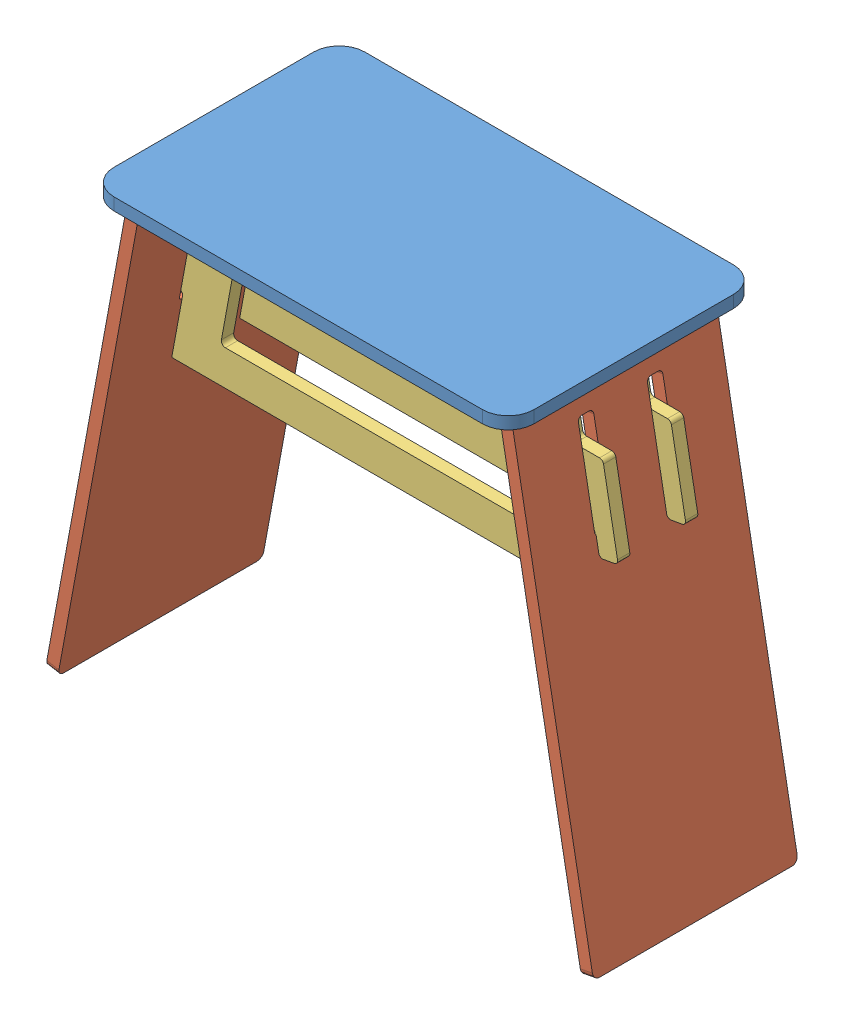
SolidWorks assembly Assem1.sldasm, configuration Default (file format 10000). Lengths in mm.
Overall size (533.01 452.79 245).
5 component instances, 3 part files, 14 mates.
Components (placement in the parent):
- base-1: base.SLDPRT [Default] at (76.5416 12 -122.5) x (0 0 -1) z (-1 0 0) size (245 12 410)
- legs-1: legs.SLDPRT [Default] at (290.2888 -218.4832 -121.7633) x (0.181175 -0.983451 0) z (0 0 1) size (452.1 12 200)
- Spine-1: Spine.SLDPRT [Default] at (-129.8084 -178.33 -94.79) x (1 0 0) z (0 -1 0) size (458.04 12 184.33)
- legs-2: legs.SLDPRT [Default] at (-149.007 -216.3091 -119.8633) x (-0.181175 -0.983451 0) z (0 0 1) size (452.1 12 200)
- Spine-2: Spine.SLDPRT [Default] at (-129.8084 -178.33 -161.12) x (1 0 0) z (0 -1 0) size (458.04 12 184.33)
Mates (geometry in assembly coordinates):
- Coincident2: coincident: plane of base-1 through (76.5416 0 -122.5) normal (0 -1 0); plane of assembly through (0 0 0) normal (0 1 0)
- Coincident3: coincident aligned: plane of base-1 through (76.5416 0 0) normal (0 0 1); plane of assembly through (0 0 0) normal (0 0 1)
- Coincident4: coincident: plane of base-1 through (76.5416 6 -122.5) normal (0 -1 0); plane of Spine-2 through (249.5416 6 -149.12) normal (0 1 0)
- Coincident5: coincident: plane of base-1 through (76.5416 6 -122.5) normal (0 -1 0); plane of Spine-1 through (249.5416 6 -82.79) normal (0 1 0)
- Coincident6: coincident: plane of base-1 through (76.5416 0 -94.79) normal (0 0 1); plane of Spine-1 through (-123.2185 -120.4806 -94.79) normal (0 0 -1)
- Coincident7: coincident: plane of base-1 through (76.5416 0 -149.12) normal (0 0 -1); plane of Spine-2 through (-123.2185 -120.4806 -149.12) normal (0 0 1)
- Coincident8: coincident aligned: plane of base-1 through (249.5416 0 -122.5) normal (1 0 0); plane of Spine-1 through (249.5416 2.7 -82.79) normal (1 0 0)
- Coincident9: coincident aligned: plane of base-1 through (249.5416 0 -122.5) normal (1 0 0); plane of Spine-2 through (249.5416 2.7 -149.12) normal (1 0 0)
- Coincident10: coincident: plane of legs-1 through (268.4696 -33.8101 -149.12) normal (0 0 -1); plane of Spine-2 through (-123.2185 -120.4806 -149.12) normal (0 0 1)
- Coincident11: coincident: plane of legs-1 through (330.1563 -434.8915 -27.7633) normal (-0.983451 -0.181175 0); plane of Spine-2 through (272.3679 -121.2053 -149.12) normal (0.983451 0.181175 0)
- Coincident12: coincident: plane of base-1 through (76.5416 6 -122.5) normal (0 -1 0); line of legs-1 through (261.1356 6 -221.7633) axis (0 0 1)
- Coincident13: coincident: plane of Spine-1 through (-123.2185 -120.4806 -94.79) normal (0 0 -1); plane of legs-2 through (-103.5849 -35.9842 -94.79) normal (0 0 1)
- Coincident14: coincident: plane of Spine-1 through (-106.3834 -51.1747 -82.79) normal (-0.983451 0.181175 0); plane of legs-2 through (-177.0731 -434.8915 -25.8633) normal (0.983451 -0.181175 0)
- Coincident15: coincident: plane of base-1 through (76.5416 6 -122.5) normal (0 -1 0); line of legs-2 through (-108.0524 6 -219.8633) axis (0 0 1)
